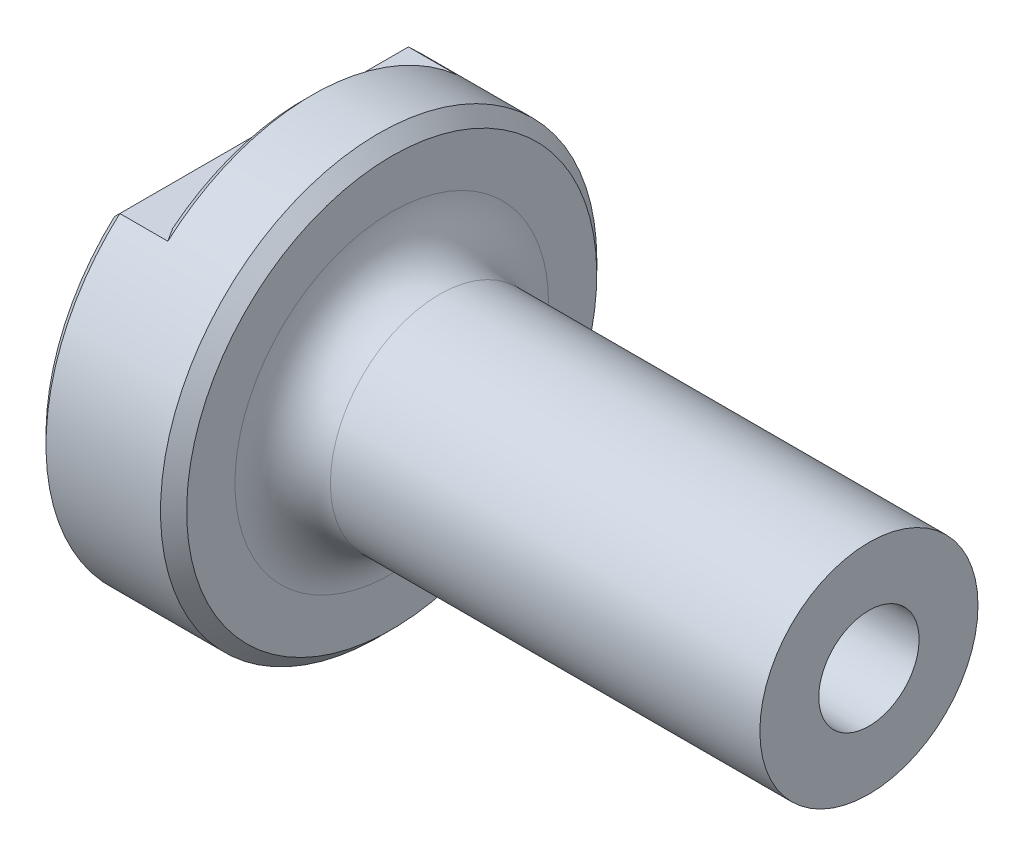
from build123d import *

# Parameters (mm, degrees)
SKETCH1_R           = 25.4
BOSS_EXTRUDE1_DEPTH = 35.71875
SKETCH3_W           = 50.8
SKETCH3_H           = 6.35
CUT_EXTRUDE1_DEPTH  = 5.588
SKETCH5_W           = 55.5625
SKETCH5_H           = 12.7
FILLET1_R           = 5.55625
CHAMFER1_SIZE       = 1.524
CHAMFER2_SIZE       = 1.016


with BuildPart() as part:
    # Sketch1 → Boss-Extrude1 (new, symmetric)
    with BuildSketch(Plane(origin=(0, 0, 0), x_dir=(0, 0, -1), z_dir=(1, 0, 0))):
        Circle(SKETCH1_R)
    extrude(amount=BOSS_EXTRUDE1_DEPTH, both=True)

    # Sketch3 → Cut-Extrude1 (cut)
    with BuildSketch(Plane.ZY.offset(35.71875)):
        with Locations((0, 22.225)):
            Rectangle(SKETCH3_W, SKETCH3_H)
    extrude(amount=-CUT_EXTRUDE1_DEPTH, mode=Mode.SUBTRACT)

    # Sketch5 → Cut-Revolve1 (revolve, cut)
    with BuildSketch(Plane.XY, mode=Mode.PRIVATE) as cut_revolve1_sk:
        with Locations((7.9375, -19.05)):
            Rectangle(SKETCH5_W, SKETCH5_H)
    revolve(cut_revolve1_sk.sketch.rotate(Axis((35.71875, 0, 0), (-1, 0, 0)), 138.590377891), axis=Axis((35.71875, 0, 0), (-1, 0, 0)), mode=Mode.SUBTRACT)

    # Sketch6 → Cut-Revolve2 (revolve, cut)
    with BuildSketch(Plane.XY):
        with BuildLine():
            Line((-31.09595, 0), (-35.71875, 0))
            Line((-35.71875, 0), (-35.71875, 9.800451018))
            ThreePointArc((-35.71875, 9.800451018), (-32.309644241, 5.418005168), (-31.09595, 0))
        make_face()
    revolve(axis=Axis((35.71875, 0, 0), (-1, 0, 0)), mode=Mode.SUBTRACT)

    # Sketch7 → Cut-Revolve3 (revolve, cut)
    with BuildSketch(Plane.XY):
        Polygon((-31.869872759, 4.365625), (35.71875, 5.840413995), (35.71875, 0), (-31.869872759, 0), align=None)
    revolve(axis=Axis((35.71875, 0, 0), (-1, 0, 0)), mode=Mode.SUBTRACT)

    # Fillet1
    fillet1_edges = [part.edges().sort_by_distance(p)[0] for p in [
        (-19.84375, -9.525, -8.400260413),
    ]]
    fillet(fillet1_edges, radius=FILLET1_R)

    # Chamfer1
    chamfer1_edges = [part.edges().sort_by_distance(p)[0] for p in [
        (-19.84375, 0, 25.4),
    ]]
    chamfer(chamfer1_edges, length=CHAMFER1_SIZE)

    # Chamfer2
    chamfer2_edges = [part.edges().sort_by_distance(p)[0] for p in [
        (-35.71875, -23.150520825, 10.450520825),
        (-35.71875, 19.05, 0),
        (-30.13075, 25.4, 0),
    ]]
    chamfer(chamfer2_edges, length=CHAMFER2_SIZE)


solid = part.part
